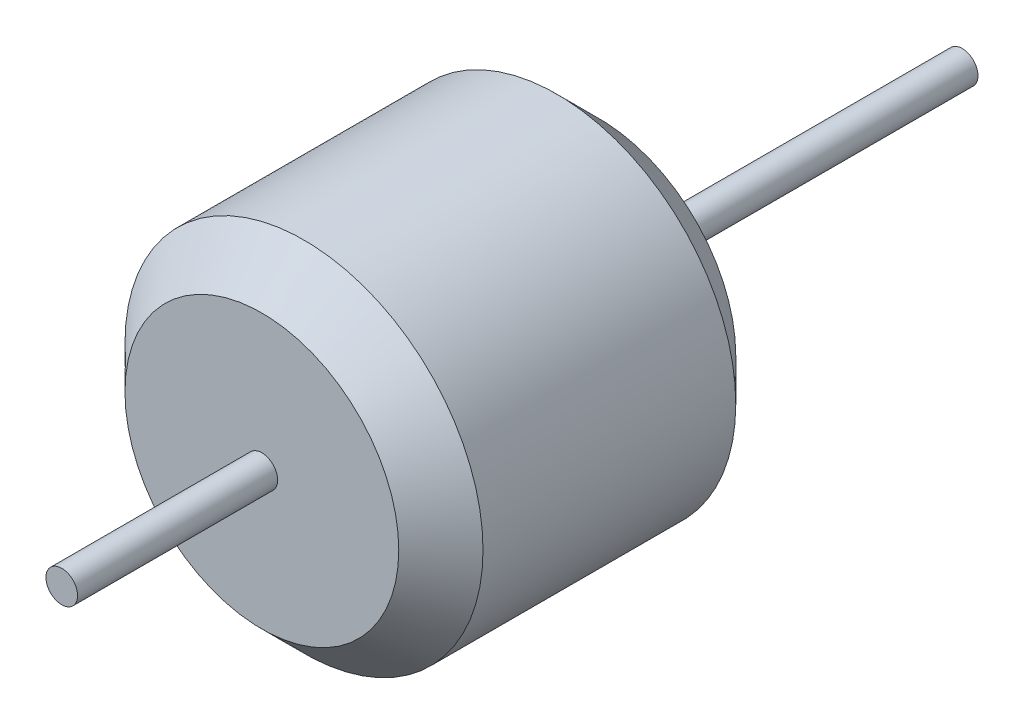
from build123d import *

# Parameters (mm, degrees)
ESQUISSE1_R             = 17
BOSS_EXTRU_1_DEPTH      = 32
CHANFREIN1_SIZE         = 4
BOSS_EXTRU_2_DEPTH      = 19
BOSS_EXTRU_2_DEPTH_BACK = 66.5
ESQUISSE2_R             = 1.5


with BuildPart() as part:
    # Esquisse1 → Boss.-Extru.1 (new body)
    with BuildSketch(Plane.XY):
        Circle(ESQUISSE1_R)
    extrude(amount=BOSS_EXTRU_1_DEPTH)

    # Chanfrein1
    chanfrein1_edges = [part.edges().sort_by_distance(p)[0] for p in [
        (-17, 0, 0),
        (-17, 0, 32),
    ]]
    chamfer(chanfrein1_edges, length=CHANFREIN1_SIZE)

    # Esquisse2 → Boss.-Extru.2 (add, two sides: drawn at the far end of the back side and taken through both)
    with BuildSketch(Plane.XY.offset(32).offset(-BOSS_EXTRU_2_DEPTH_BACK)):
        Circle(ESQUISSE2_R)
    extrude(amount=BOSS_EXTRU_2_DEPTH + BOSS_EXTRU_2_DEPTH_BACK)


solid = part.part
